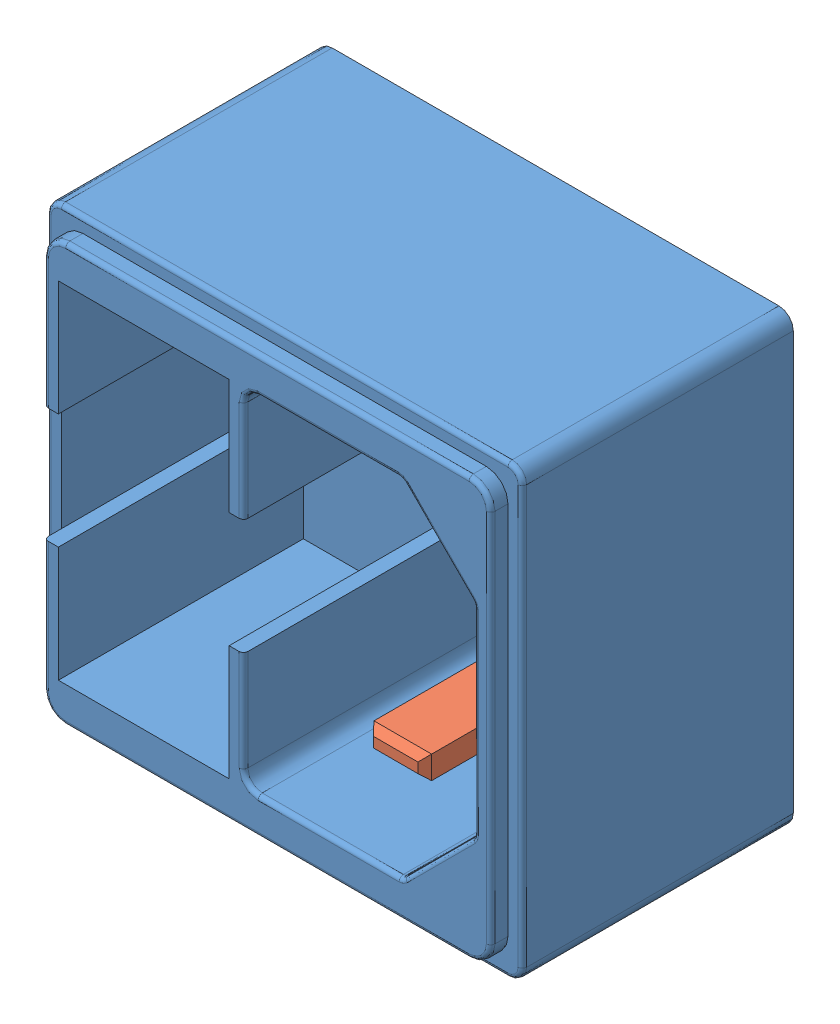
SolidWorks assembly BAlim_Bloc.SLDASM, configuration Défaut (file format 13000). Lengths in mm.
Overall size (33 31 20).
4 component instances, 2 part files, 9 mates.
Components (placement in the parent):
- BAlim_Bloc-1: BAlim_Bloc.SLDPRT [Défaut] at (-46.6014 -14.5774 -10) size (33 31 20)
- BAlim_Pin-1: BAlim_Pin.SLDPRT [Défaut] at (-28.2007 9.9113 -10) size (4 1.6 15)
- BAlim_Pin-2: BAlim_Pin.SLDPRT [Défaut] at (-20.1655 0.1226 -10) size (4 1.6 15)
- BAlim_Pin-3: BAlim_Pin.SLDPRT [Défaut] at (-28.2007 -9.666 -10) size (4 1.6 15)
Mates (geometry in assembly coordinates):
- Coïncidente4: coincident anti-aligned: plane of BAlim_Bloc-1 through (-24.2007 11.5113 -10.001) normal (-1 0 0); plane of BAlim_Pin-1 through (-24.2007 9.9113 5) normal (1 0 0)
- Coïncidente5: coincident anti-aligned: plane of BAlim_Bloc-1 through (-28.2007 11.5113 -10.001) normal (0 -1 0); plane of BAlim_Pin-1 through (-28.2007 11.5113 5) normal (0 1 0)
- Coïncidente6: coincident anti-aligned: plane of BAlim_Bloc-1 through (-28.2007 -8.066 -10.001) normal (0 -1 0); plane of BAlim_Pin-3 through (-28.2007 -8.066 5) normal (0 1 0)
- Coïncidente7: coincident anti-aligned: plane of BAlim_Bloc-1 through (-28.2007 -8.066 -10.001) normal (1 0 0); plane of BAlim_Pin-3 through (-28.2007 -9.666 5) normal (-1 0 0)
- Coïncidente8: coincident anti-aligned: plane of BAlim_Bloc-1 through (-16.1655 0.1226 -10.001) normal (0 1 0); plane of BAlim_Pin-2 through (-20.1655 0.1226 5) normal (0 -1 0)
- Coïncidente9: coincident anti-aligned: plane of BAlim_Bloc-1 through (-20.1655 1.7226 -10.001) normal (1 0 0); plane of BAlim_Pin-2 through (-20.1655 0.1226 5) normal (-1 0 0)
- Coïncidente10: coincident aligned: plane of BAlim_Bloc-1 through (-45.6014 15.4226 -10) normal (0 0 -1); plane of BAlim_Pin-1 through (-28.2007 9.9113 -10) normal (0 0 -1)
- Coïncidente11: coincident aligned: plane of BAlim_Bloc-1 through (-45.6014 15.4226 -10) normal (0 0 -1); plane of BAlim_Pin-2 through (-20.1655 0.1226 -10) normal (0 0 -1)
- Coïncidente12: coincident aligned: plane of BAlim_Bloc-1 through (-45.6014 15.4226 -10) normal (0 0 -1); plane of BAlim_Pin-3 through (-28.2007 -9.666 -10) normal (0 0 -1)
